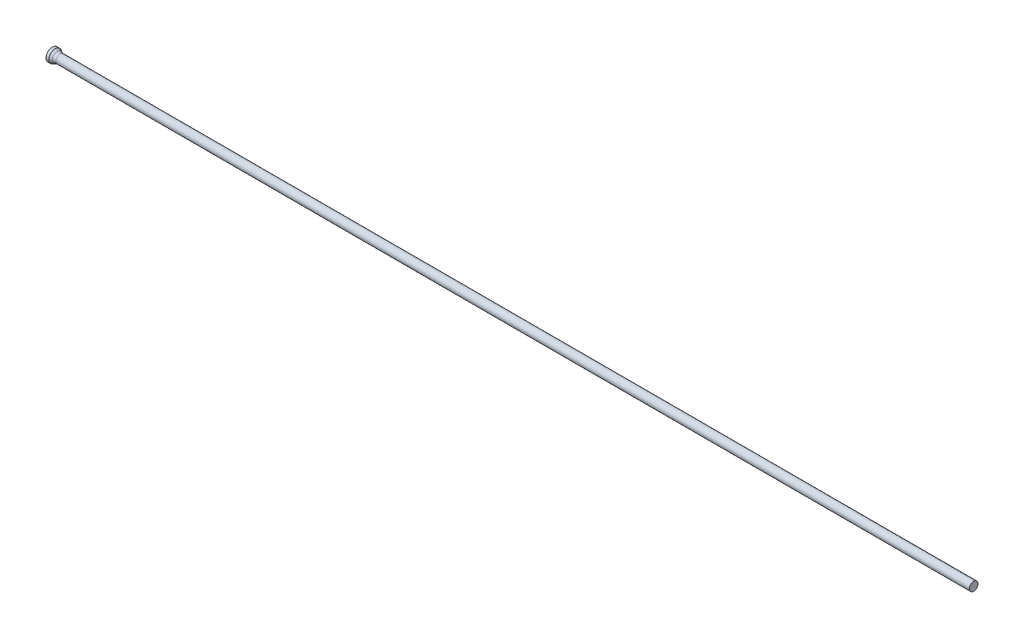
ISO-10303-21;
HEADER;
FILE_DESCRIPTION(('STEP AP214'),'2;1');
FILE_NAME('part.step','',(''),(''),'','','');
FILE_SCHEMA(('AUTOMOTIVE_DESIGN { 1 0 10303 214 1 1 1 1 }'));
ENDSEC;
DATA;
#1=APPLICATION_CONTEXT('core data for automotive mechanical design processes');
#2=APPLICATION_PROTOCOL_DEFINITION('international standard','automotive_design',2000,#1);
#3=PRODUCT_CONTEXT('',#1,'mechanical');
#4=PRODUCT('Part','Part','',(#3));
#5=PRODUCT_RELATED_PRODUCT_CATEGORY('part','',(#4));
#6=PRODUCT_DEFINITION_FORMATION('','',#4);
#7=PRODUCT_DEFINITION_CONTEXT('part definition',#1,'design');
#8=PRODUCT_DEFINITION('design','',#6,#7);
#9=PRODUCT_DEFINITION_SHAPE('','',#8);
#10=(LENGTH_UNIT() NAMED_UNIT(*) SI_UNIT(.MILLI.,.METRE.));
#11=(NAMED_UNIT(*) PLANE_ANGLE_UNIT() SI_UNIT($,.RADIAN.));
#12=(NAMED_UNIT(*) SI_UNIT($,.STERADIAN.) SOLID_ANGLE_UNIT());
#13=UNCERTAINTY_MEASURE_WITH_UNIT(LENGTH_MEASURE(1.E-05),#10,'distance_accuracy_value','');
#14=(GEOMETRIC_REPRESENTATION_CONTEXT(3) GLOBAL_UNCERTAINTY_ASSIGNED_CONTEXT((#13)) GLOBAL_UNIT_ASSIGNED_CONTEXT((#10,
#11,#12)) REPRESENTATION_CONTEXT('',''));
#15=CARTESIAN_POINT('',(0.,0.,0.));
#16=DIRECTION('',(0.,0.,1.));
#17=DIRECTION('',(1.,0.,0.));
#18=AXIS2_PLACEMENT_3D('',#15,#16,#17);
#19=CARTESIAN_POINT('',(0.,0.,0.));
#20=DIRECTION('',(1.,0.,0.));
#21=DIRECTION('',(0.,0.,-1.));
#22=AXIS2_PLACEMENT_3D('',#19,#20,#21);
#23=PLANE('',#22);
#24=CARTESIAN_POINT('',(0.,0.,0.));
#25=DIRECTION('',(-1.,0.,0.));
#26=DIRECTION('',(0.,0.,1.));
#27=AXIS2_PLACEMENT_3D('',#24,#25,#26);
#28=CIRCLE('',#27,1.1);
#29=CARTESIAN_POINT('',(0.,0.,1.1));
#30=VERTEX_POINT('',#29);
#31=EDGE_CURVE('E25',#30,#30,#28,.T.);
#32=ORIENTED_EDGE('',*,*,#31,.T.);
#33=EDGE_LOOP('',(#32));
#34=FACE_BOUND('',#33,.T.);
#35=ADVANCED_FACE('F14',(#34),#23,.F.);
#36=CARTESIAN_POINT('',(0.,0.,0.));
#37=DIRECTION('',(-1.,0.,0.));
#38=DIRECTION('',(0.,0.,1.));
#39=AXIS2_PLACEMENT_3D('',#36,#37,#38);
#40=CYLINDRICAL_SURFACE('',#39,1.1);
#41=ORIENTED_EDGE('',*,*,#31,.F.);
#42=EDGE_LOOP('',(#41));
#43=FACE_BOUND('',#42,.T.);
#44=CARTESIAN_POINT('',(0.503782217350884,0.,0.));
#45=DIRECTION('',(-1.,0.,0.));
#46=DIRECTION('',(0.,0.,1.));
#47=AXIS2_PLACEMENT_3D('',#44,#45,#46);
#48=CIRCLE('',#47,1.1);
#49=CARTESIAN_POINT('',(0.503782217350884,0.,1.1));
#50=VERTEX_POINT('',#49);
#51=EDGE_CURVE('E29',#50,#50,#48,.T.);
#52=ORIENTED_EDGE('',*,*,#51,.T.);
#53=EDGE_LOOP('',(#52));
#54=FACE_BOUND('',#53,.T.);
#55=ADVANCED_FACE('F53',(#43,#54),#40,.T.);
#56=CARTESIAN_POINT('',(1.11,0.,0.));
#57=DIRECTION('',(-1.,0.,0.));
#58=DIRECTION('',(0.,0.,1.));
#59=AXIS2_PLACEMENT_3D('',#56,#57,#58);
#60=CONICAL_SURFACE('',#59,0.75,0.523598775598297);
#61=CARTESIAN_POINT('',(0.877949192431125,0.,0.));
#62=DIRECTION('',(-1.,0.,0.));
#63=DIRECTION('',(0.,0.,1.));
#64=AXIS2_PLACEMENT_3D('',#61,#62,#63);
#65=CIRCLE('',#64,0.883974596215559);
#66=CARTESIAN_POINT('',(0.877949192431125,0.,0.883974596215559));
#67=VERTEX_POINT('',#66);
#68=EDGE_CURVE('E21',#67,#67,#65,.T.);
#69=ORIENTED_EDGE('',*,*,#68,.T.);
#70=EDGE_LOOP('',(#69));
#71=FACE_BOUND('',#70,.T.);
#72=ORIENTED_EDGE('',*,*,#51,.F.);
#73=EDGE_LOOP('',(#72));
#74=FACE_BOUND('',#73,.T.);
#75=ADVANCED_FACE('F50',(#71,#74),#60,.T.);
#76=CARTESIAN_POINT('',(0.,0.,0.));
#77=DIRECTION('',(-1.,0.,0.));
#78=DIRECTION('',(0.,0.,1.));
#79=AXIS2_PLACEMENT_3D('',#76,#77,#78);
#80=CYLINDRICAL_SURFACE('',#79,0.75);
#81=CARTESIAN_POINT('',(1.37794919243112,0.,0.));
#82=DIRECTION('',(-1.,0.,0.));
#83=DIRECTION('',(0.,0.,1.));
#84=AXIS2_PLACEMENT_3D('',#81,#82,#83);
#85=CIRCLE('',#84,0.75);
#86=CARTESIAN_POINT('',(1.37794919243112,0.,0.75));
#87=VERTEX_POINT('',#86);
#88=EDGE_CURVE('E9',#87,#87,#85,.F.);
#89=ORIENTED_EDGE('',*,*,#88,.T.);
#90=EDGE_LOOP('',(#89));
#91=FACE_BOUND('',#90,.T.);
#92=CARTESIAN_POINT('',(160.,0.,0.));
#93=DIRECTION('',(-1.,0.,0.));
#94=DIRECTION('',(0.,0.,1.));
#95=AXIS2_PLACEMENT_3D('',#92,#93,#94);
#96=CIRCLE('',#95,0.75);
#97=CARTESIAN_POINT('',(160.,0.,0.75));
#98=VERTEX_POINT('',#97);
#99=EDGE_CURVE('E34',#98,#98,#96,.T.);
#100=ORIENTED_EDGE('',*,*,#99,.T.);
#101=EDGE_LOOP('',(#100));
#102=FACE_BOUND('',#101,.T.);
#103=ADVANCED_FACE('F38',(#91,#102),#80,.T.);
#104=CARTESIAN_POINT('',(160.,0.75,0.));
#105=DIRECTION('',(-1.,0.,0.));
#106=DIRECTION('',(0.,0.,1.));
#107=AXIS2_PLACEMENT_3D('',#104,#105,#106);
#108=PLANE('',#107);
#109=ORIENTED_EDGE('',*,*,#99,.F.);
#110=EDGE_LOOP('',(#109));
#111=FACE_BOUND('',#110,.T.);
#112=ADVANCED_FACE('F40',(#111),#108,.F.);
#113=CARTESIAN_POINT('',(1.37794919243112,0.,0.));
#114=DIRECTION('',(-1.,0.,0.));
#115=DIRECTION('',(0.,0.,1.));
#116=AXIS2_PLACEMENT_3D('',#113,#114,#115);
#117=TOROIDAL_SURFACE('',#116,1.75,1.);
#118=ORIENTED_EDGE('',*,*,#88,.F.);
#119=EDGE_LOOP('',(#118));
#120=FACE_BOUND('',#119,.T.);
#121=ORIENTED_EDGE('',*,*,#68,.F.);
#122=EDGE_LOOP('',(#121));
#123=FACE_BOUND('',#122,.T.);
#124=ADVANCED_FACE('F16',(#120,#123),#117,.F.);
#125=CLOSED_SHELL('',(#35,#55,#75,#103,#112,#124));
#126=MANIFOLD_SOLID_BREP('B1',#125);
#127=ADVANCED_BREP_SHAPE_REPRESENTATION('',(#18,#126),#14);
#128=SHAPE_DEFINITION_REPRESENTATION(#9,#127);
ENDSEC;
END-ISO-10303-21;
